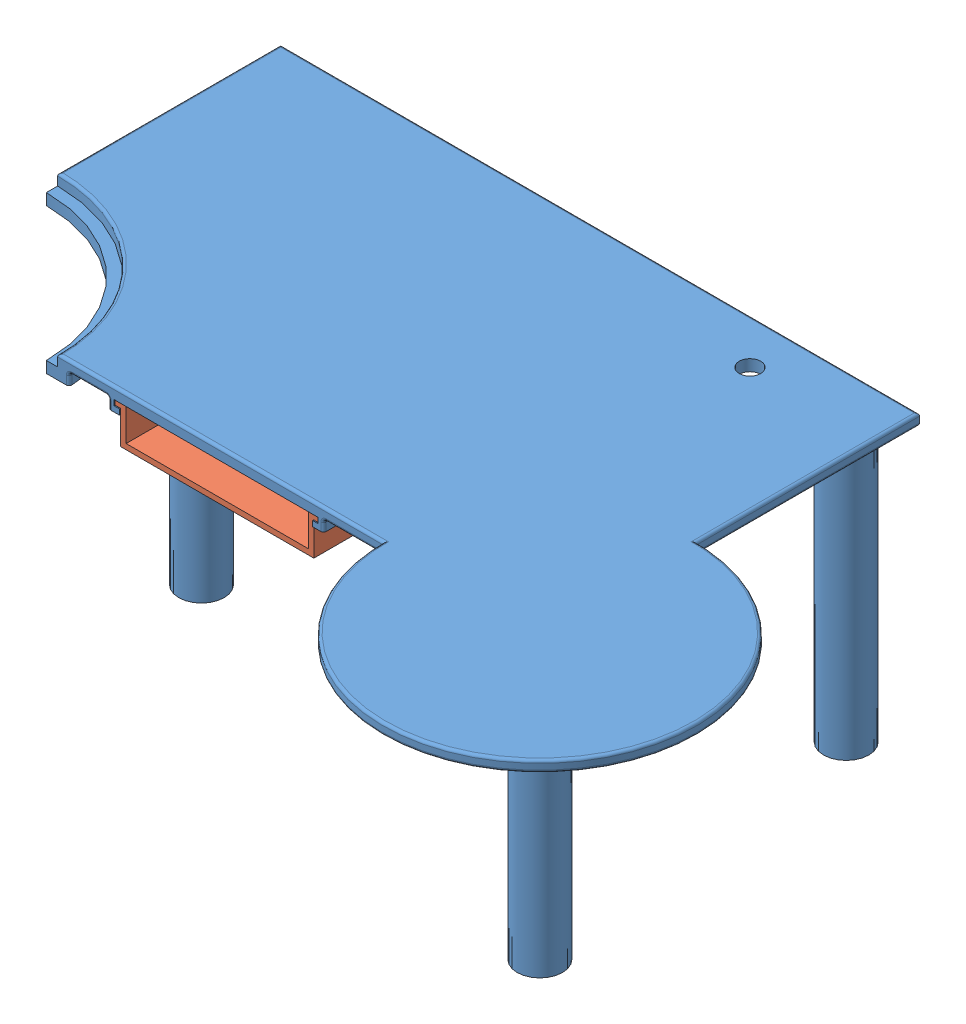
SolidWorks assembly User Library-desk layout.SLDASM, configuration Default (file format 4700). Lengths in mm.
Overall size (148.57 52.92 100.19).
2 component instances, 2 part files, 2 mates.
Components (placement in the parent):
- User Library-desk layout_desk top-1: User Library-desk layout_desk top.SLDPRT [Default] at (-26.0052 21.858 51.5579) size (148.57 52.92 100.19)
- User Library-desk layout_keyboard tray1-1: User Library-desk layout_keyboard tray1.SLDPRT [Default] at (-34.0821 18.4021 14.7859) size (38.24 7.16 26.42)
Mates (geometry in assembly coordinates):
- Coincident1: coincident anti-aligned: plane of User Library-desk layout_desk top-1 through (-170.9359 21.858 15.4627) normal (0 -1 0); plane of User Library-desk layout_keyboard tray1-1 through (-49.1743 21.858 40.1859) normal (0 1 0)
- Coincident2: coincident anti-aligned: plane of User Library-desk layout_desk top-1 through (-68.2962 -27.1707 14.9472) normal (1 0 0); plane of User Library-desk layout_keyboard tray1-1 through (-68.2962 -12.1288 40.1859) normal (-1 0 0)
